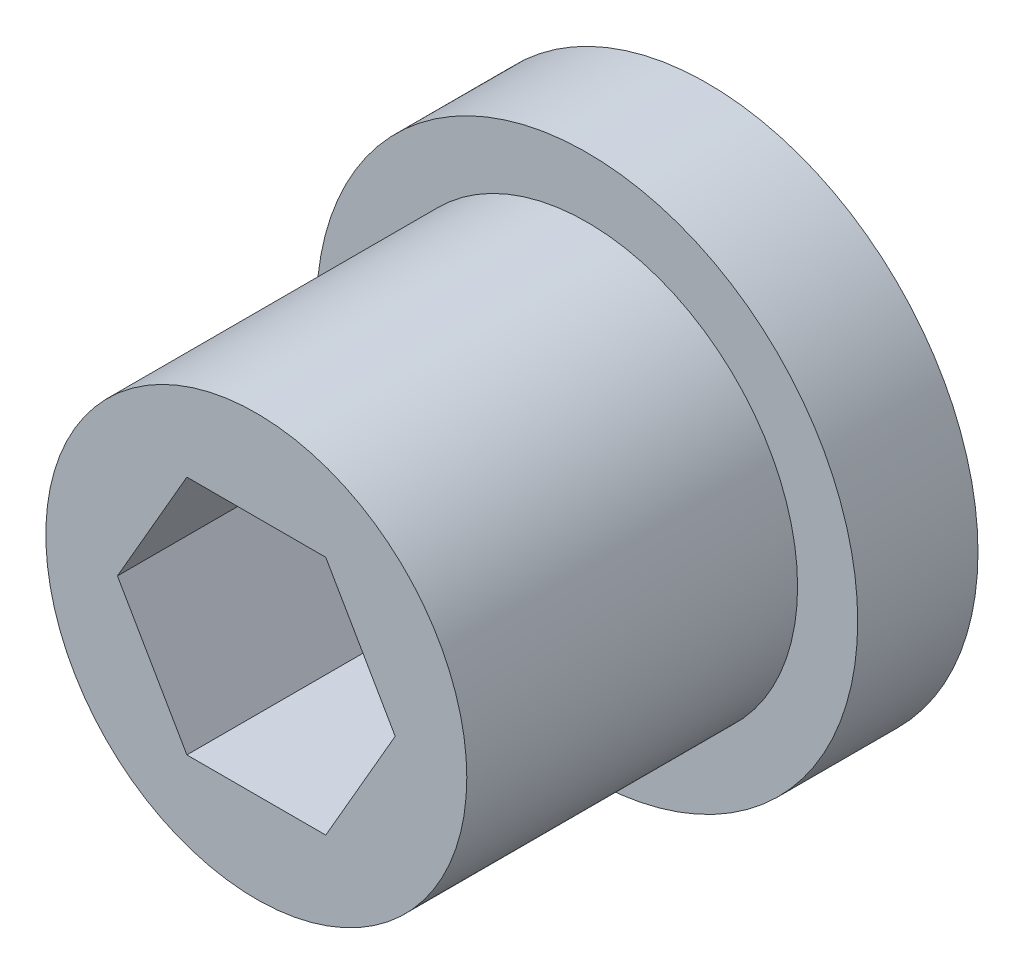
ISO-10303-21;
HEADER;
FILE_DESCRIPTION(('STEP AP214'),'2;1');
FILE_NAME('part.step','',(''),(''),'','','');
FILE_SCHEMA(('AUTOMOTIVE_DESIGN { 1 0 10303 214 1 1 1 1 }'));
ENDSEC;
DATA;
#1=APPLICATION_CONTEXT('core data for automotive mechanical design processes');
#2=APPLICATION_PROTOCOL_DEFINITION('international standard','automotive_design',2000,#1);
#3=PRODUCT_CONTEXT('',#1,'mechanical');
#4=PRODUCT('Part','Part','',(#3));
#5=PRODUCT_RELATED_PRODUCT_CATEGORY('part','',(#4));
#6=PRODUCT_DEFINITION_FORMATION('','',#4);
#7=PRODUCT_DEFINITION_CONTEXT('part definition',#1,'design');
#8=PRODUCT_DEFINITION('design','',#6,#7);
#9=PRODUCT_DEFINITION_SHAPE('','',#8);
#10=(LENGTH_UNIT() NAMED_UNIT(*) SI_UNIT(.MILLI.,.METRE.));
#11=(NAMED_UNIT(*) PLANE_ANGLE_UNIT() SI_UNIT($,.RADIAN.));
#12=(NAMED_UNIT(*) SI_UNIT($,.STERADIAN.) SOLID_ANGLE_UNIT());
#13=UNCERTAINTY_MEASURE_WITH_UNIT(LENGTH_MEASURE(1.E-05),#10,'distance_accuracy_value','');
#14=(GEOMETRIC_REPRESENTATION_CONTEXT(3) GLOBAL_UNCERTAINTY_ASSIGNED_CONTEXT((#13)) GLOBAL_UNIT_ASSIGNED_CONTEXT((#10,
#11,#12)) REPRESENTATION_CONTEXT('',''));
#15=CARTESIAN_POINT('',(0.,0.,0.));
#16=DIRECTION('',(0.,0.,1.));
#17=DIRECTION('',(1.,0.,0.));
#18=AXIS2_PLACEMENT_3D('',#15,#16,#17);
#19=CARTESIAN_POINT('',(0.,0.,2.));
#20=DIRECTION('',(0.,0.,-1.));
#21=DIRECTION('',(-1.,0.,0.));
#22=AXIS2_PLACEMENT_3D('',#19,#20,#21);
#23=CYLINDRICAL_SURFACE('',#22,4.5);
#24=CARTESIAN_POINT('',(0.,0.,2.));
#25=DIRECTION('',(0.,0.,1.));
#26=DIRECTION('',(1.,0.,0.));
#27=AXIS2_PLACEMENT_3D('',#24,#25,#26);
#28=CIRCLE('',#27,4.5);
#29=CARTESIAN_POINT('',(4.5,0.,2.));
#30=VERTEX_POINT('',#29);
#31=EDGE_CURVE('E33',#30,#30,#28,.T.);
#32=ORIENTED_EDGE('',*,*,#31,.F.);
#33=EDGE_LOOP('',(#32));
#34=FACE_BOUND('',#33,.T.);
#35=CARTESIAN_POINT('',(0.,0.,0.));
#36=DIRECTION('',(0.,0.,1.));
#37=DIRECTION('',(1.,0.,0.));
#38=AXIS2_PLACEMENT_3D('',#35,#36,#37);
#39=CIRCLE('',#38,4.5);
#40=CARTESIAN_POINT('',(4.5,0.,0.));
#41=VERTEX_POINT('',#40);
#42=EDGE_CURVE('E138',#41,#41,#39,.T.);
#43=ORIENTED_EDGE('',*,*,#42,.T.);
#44=EDGE_LOOP('',(#43));
#45=FACE_BOUND('',#44,.T.);
#46=ADVANCED_FACE('F30',(#34,#45),#23,.T.);
#47=CARTESIAN_POINT('',(0.,0.,2.));
#48=DIRECTION('',(0.,0.,1.));
#49=DIRECTION('',(1.,0.,0.));
#50=AXIS2_PLACEMENT_3D('',#47,#48,#49);
#51=PLANE('',#50);
#52=CARTESIAN_POINT('',(0.,0.,2.));
#53=DIRECTION('',(0.,0.,1.));
#54=DIRECTION('',(1.,0.,0.));
#55=AXIS2_PLACEMENT_3D('',#52,#53,#54);
#56=CIRCLE('',#55,3.5);
#57=CARTESIAN_POINT('',(3.5,0.,2.));
#58=VERTEX_POINT('',#57);
#59=EDGE_CURVE('E11',#58,#58,#56,.T.);
#60=ORIENTED_EDGE('',*,*,#59,.F.);
#61=EDGE_LOOP('',(#60));
#62=FACE_BOUND('',#61,.T.);
#63=ORIENTED_EDGE('',*,*,#31,.T.);
#64=EDGE_LOOP('',(#63));
#65=FACE_BOUND('',#64,.T.);
#66=ADVANCED_FACE('F145',(#62,#65),#51,.T.);
#67=CARTESIAN_POINT('',(0.,0.,0.));
#68=DIRECTION('',(0.,0.,1.));
#69=DIRECTION('',(1.,0.,0.));
#70=AXIS2_PLACEMENT_3D('',#67,#68,#69);
#71=PLANE('',#70);
#72=DIRECTION('',(-1.,0.,0.));
#73=VECTOR('',#72,1.);
#74=CARTESIAN_POINT('',(-1.15470053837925,2.,0.));
#75=LINE('',#74,#73);
#76=CARTESIAN_POINT('',(1.15470053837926,2.,0.));
#77=VERTEX_POINT('',#76);
#78=CARTESIAN_POINT('',(-1.15470053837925,2.,0.));
#79=VERTEX_POINT('',#78);
#80=EDGE_CURVE('E125',#77,#79,#75,.T.);
#81=ORIENTED_EDGE('',*,*,#80,.T.);
#82=DIRECTION('',(-0.499999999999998,-0.86602540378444,0.));
#83=VECTOR('',#82,1.);
#84=CARTESIAN_POINT('',(-1.15470053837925,2.,0.));
#85=LINE('',#84,#83);
#86=CARTESIAN_POINT('',(-2.3094010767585,0.,0.));
#87=VERTEX_POINT('',#86);
#88=EDGE_CURVE('E113',#79,#87,#85,.T.);
#89=ORIENTED_EDGE('',*,*,#88,.T.);
#90=DIRECTION('',(0.499999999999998,-0.866025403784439,0.));
#91=VECTOR('',#90,1.);
#92=CARTESIAN_POINT('',(-1.15470053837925,-2.,0.));
#93=LINE('',#92,#91);
#94=CARTESIAN_POINT('',(-1.15470053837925,-2.,0.));
#95=VERTEX_POINT('',#94);
#96=EDGE_CURVE('E116',#87,#95,#93,.T.);
#97=ORIENTED_EDGE('',*,*,#96,.T.);
#98=DIRECTION('',(1.,0.,0.));
#99=VECTOR('',#98,1.);
#100=CARTESIAN_POINT('',(-1.15470053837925,-2.,0.));
#101=LINE('',#100,#99);
#102=CARTESIAN_POINT('',(1.15470053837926,-2.,0.));
#103=VERTEX_POINT('',#102);
#104=EDGE_CURVE('E45',#95,#103,#101,.T.);
#105=ORIENTED_EDGE('',*,*,#104,.T.);
#106=DIRECTION('',(0.499999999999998,0.86602540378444,0.));
#107=VECTOR('',#106,1.);
#108=CARTESIAN_POINT('',(1.15470053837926,-2.,0.));
#109=LINE('',#108,#107);
#110=CARTESIAN_POINT('',(2.3094010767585,0.,0.));
#111=VERTEX_POINT('',#110);
#112=EDGE_CURVE('E119',#103,#111,#109,.T.);
#113=ORIENTED_EDGE('',*,*,#112,.T.);
#114=DIRECTION('',(-0.499999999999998,0.86602540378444,0.));
#115=VECTOR('',#114,1.);
#116=CARTESIAN_POINT('',(1.15470053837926,2.,0.));
#117=LINE('',#116,#115);
#118=EDGE_CURVE('E122',#111,#77,#117,.T.);
#119=ORIENTED_EDGE('',*,*,#118,.T.);
#120=EDGE_LOOP('',(#81,#89,#97,#105,#113,#119));
#121=FACE_BOUND('',#120,.T.);
#122=ORIENTED_EDGE('',*,*,#42,.F.);
#123=EDGE_LOOP('',(#122));
#124=FACE_BOUND('',#123,.T.);
#125=ADVANCED_FACE('F151',(#121,#124),#71,.F.);
#126=CARTESIAN_POINT('',(0.,0.,7.5));
#127=DIRECTION('',(0.,0.,-1.));
#128=DIRECTION('',(-1.,0.,0.));
#129=AXIS2_PLACEMENT_3D('',#126,#127,#128);
#130=CYLINDRICAL_SURFACE('',#129,3.5);
#131=CARTESIAN_POINT('',(0.,0.,7.5));
#132=DIRECTION('',(0.,0.,1.));
#133=DIRECTION('',(1.,0.,0.));
#134=AXIS2_PLACEMENT_3D('',#131,#132,#133);
#135=CIRCLE('',#134,3.5);
#136=CARTESIAN_POINT('',(3.5,0.,7.5));
#137=VERTEX_POINT('',#136);
#138=EDGE_CURVE('E130',#137,#137,#135,.T.);
#139=ORIENTED_EDGE('',*,*,#138,.F.);
#140=EDGE_LOOP('',(#139));
#141=FACE_BOUND('',#140,.T.);
#142=ORIENTED_EDGE('',*,*,#59,.T.);
#143=EDGE_LOOP('',(#142));
#144=FACE_BOUND('',#143,.T.);
#145=ADVANCED_FACE('F156',(#141,#144),#130,.T.);
#146=CARTESIAN_POINT('',(0.,0.,7.5));
#147=DIRECTION('',(0.,0.,1.));
#148=DIRECTION('',(1.,0.,0.));
#149=AXIS2_PLACEMENT_3D('',#146,#147,#148);
#150=PLANE('',#149);
#151=DIRECTION('',(-0.499999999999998,-0.86602540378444,0.));
#152=VECTOR('',#151,1.);
#153=CARTESIAN_POINT('',(-1.15470053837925,2.,7.5));
#154=LINE('',#153,#152);
#155=CARTESIAN_POINT('',(-1.15470053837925,2.,7.5));
#156=VERTEX_POINT('',#155);
#157=CARTESIAN_POINT('',(-2.3094010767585,0.,7.5));
#158=VERTEX_POINT('',#157);
#159=EDGE_CURVE('E53',#156,#158,#154,.T.);
#160=ORIENTED_EDGE('',*,*,#159,.F.);
#161=DIRECTION('',(-1.,0.,0.));
#162=VECTOR('',#161,1.);
#163=CARTESIAN_POINT('',(-1.15470053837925,2.,7.5));
#164=LINE('',#163,#162);
#165=CARTESIAN_POINT('',(1.15470053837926,2.,7.5));
#166=VERTEX_POINT('',#165);
#167=EDGE_CURVE('E110',#166,#156,#164,.T.);
#168=ORIENTED_EDGE('',*,*,#167,.F.);
#169=DIRECTION('',(-0.499999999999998,0.86602540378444,0.));
#170=VECTOR('',#169,1.);
#171=CARTESIAN_POINT('',(1.15470053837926,2.,7.5));
#172=LINE('',#171,#170);
#173=CARTESIAN_POINT('',(2.3094010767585,0.,7.5));
#174=VERTEX_POINT('',#173);
#175=EDGE_CURVE('E104',#174,#166,#172,.T.);
#176=ORIENTED_EDGE('',*,*,#175,.F.);
#177=DIRECTION('',(0.499999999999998,0.86602540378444,0.));
#178=VECTOR('',#177,1.);
#179=CARTESIAN_POINT('',(1.15470053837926,-2.,7.5));
#180=LINE('',#179,#178);
#181=CARTESIAN_POINT('',(1.15470053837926,-2.,7.5));
#182=VERTEX_POINT('',#181);
#183=EDGE_CURVE('E102',#182,#174,#180,.T.);
#184=ORIENTED_EDGE('',*,*,#183,.F.);
#185=DIRECTION('',(1.,0.,0.));
#186=VECTOR('',#185,1.);
#187=CARTESIAN_POINT('',(-1.15470053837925,-2.,7.5));
#188=LINE('',#187,#186);
#189=CARTESIAN_POINT('',(-1.15470053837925,-2.,7.5));
#190=VERTEX_POINT('',#189);
#191=EDGE_CURVE('E85',#190,#182,#188,.T.);
#192=ORIENTED_EDGE('',*,*,#191,.F.);
#193=DIRECTION('',(0.499999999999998,-0.866025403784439,0.));
#194=VECTOR('',#193,1.);
#195=CARTESIAN_POINT('',(-1.15470053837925,-2.,7.5));
#196=LINE('',#195,#194);
#197=EDGE_CURVE('E94',#158,#190,#196,.T.);
#198=ORIENTED_EDGE('',*,*,#197,.F.);
#199=EDGE_LOOP('',(#160,#168,#176,#184,#192,#198));
#200=FACE_BOUND('',#199,.T.);
#201=ORIENTED_EDGE('',*,*,#138,.T.);
#202=EDGE_LOOP('',(#201));
#203=FACE_BOUND('',#202,.T.);
#204=ADVANCED_FACE('F98',(#200,#203),#150,.T.);
#205=CARTESIAN_POINT('',(-1.15470053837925,2.,0.));
#206=DIRECTION('',(-0.86602540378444,0.499999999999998,0.));
#207=DIRECTION('',(-0.499999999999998,-0.86602540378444,0.));
#208=AXIS2_PLACEMENT_3D('',#205,#206,#207);
#209=PLANE('',#208);
#210=ORIENTED_EDGE('',*,*,#159,.T.);
#211=DIRECTION('',(0.,0.,1.));
#212=VECTOR('',#211,1.);
#213=CARTESIAN_POINT('',(-2.3094010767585,0.,0.));
#214=LINE('',#213,#212);
#215=EDGE_CURVE('E91',#87,#158,#214,.T.);
#216=ORIENTED_EDGE('',*,*,#215,.F.);
#217=ORIENTED_EDGE('',*,*,#88,.F.);
#218=DIRECTION('',(0.,0.,1.));
#219=VECTOR('',#218,1.);
#220=CARTESIAN_POINT('',(-1.15470053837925,2.,0.));
#221=LINE('',#220,#219);
#222=EDGE_CURVE('E128',#79,#156,#221,.T.);
#223=ORIENTED_EDGE('',*,*,#222,.T.);
#224=EDGE_LOOP('',(#210,#216,#217,#223));
#225=FACE_BOUND('',#224,.T.);
#226=ADVANCED_FACE('F166',(#225),#209,.F.);
#227=CARTESIAN_POINT('',(-1.15470053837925,2.,0.));
#228=DIRECTION('',(0.,1.,0.));
#229=DIRECTION('',(-1.,0.,0.));
#230=AXIS2_PLACEMENT_3D('',#227,#228,#229);
#231=PLANE('',#230);
#232=ORIENTED_EDGE('',*,*,#167,.T.);
#233=ORIENTED_EDGE('',*,*,#222,.F.);
#234=ORIENTED_EDGE('',*,*,#80,.F.);
#235=DIRECTION('',(0.,0.,1.));
#236=VECTOR('',#235,1.);
#237=CARTESIAN_POINT('',(1.15470053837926,2.,0.));
#238=LINE('',#237,#236);
#239=EDGE_CURVE('E131',#77,#166,#238,.T.);
#240=ORIENTED_EDGE('',*,*,#239,.T.);
#241=EDGE_LOOP('',(#232,#233,#234,#240));
#242=FACE_BOUND('',#241,.T.);
#243=ADVANCED_FACE('F169',(#242),#231,.F.);
#244=CARTESIAN_POINT('',(1.15470053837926,2.,0.));
#245=DIRECTION('',(0.86602540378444,0.499999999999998,0.));
#246=DIRECTION('',(-0.499999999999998,0.86602540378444,0.));
#247=AXIS2_PLACEMENT_3D('',#244,#245,#246);
#248=PLANE('',#247);
#249=ORIENTED_EDGE('',*,*,#175,.T.);
#250=ORIENTED_EDGE('',*,*,#239,.F.);
#251=ORIENTED_EDGE('',*,*,#118,.F.);
#252=DIRECTION('',(0.,0.,1.));
#253=VECTOR('',#252,1.);
#254=CARTESIAN_POINT('',(2.3094010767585,0.,0.));
#255=LINE('',#254,#253);
#256=EDGE_CURVE('E133',#111,#174,#255,.T.);
#257=ORIENTED_EDGE('',*,*,#256,.T.);
#258=EDGE_LOOP('',(#249,#250,#251,#257));
#259=FACE_BOUND('',#258,.T.);
#260=ADVANCED_FACE('F177',(#259),#248,.F.);
#261=CARTESIAN_POINT('',(1.15470053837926,-2.,0.));
#262=DIRECTION('',(0.86602540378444,-0.499999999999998,0.));
#263=DIRECTION('',(0.499999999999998,0.86602540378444,0.));
#264=AXIS2_PLACEMENT_3D('',#261,#262,#263);
#265=PLANE('',#264);
#266=ORIENTED_EDGE('',*,*,#183,.T.);
#267=ORIENTED_EDGE('',*,*,#256,.F.);
#268=ORIENTED_EDGE('',*,*,#112,.F.);
#269=DIRECTION('',(0.,0.,1.));
#270=VECTOR('',#269,1.);
#271=CARTESIAN_POINT('',(1.15470053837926,-2.,0.));
#272=LINE('',#271,#270);
#273=EDGE_CURVE('E90',#103,#182,#272,.T.);
#274=ORIENTED_EDGE('',*,*,#273,.T.);
#275=EDGE_LOOP('',(#266,#267,#268,#274));
#276=FACE_BOUND('',#275,.T.);
#277=ADVANCED_FACE('F174',(#276),#265,.F.);
#278=CARTESIAN_POINT('',(-1.15470053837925,-2.,0.));
#279=DIRECTION('',(0.,-1.,0.));
#280=DIRECTION('',(1.,0.,0.));
#281=AXIS2_PLACEMENT_3D('',#278,#279,#280);
#282=PLANE('',#281);
#283=ORIENTED_EDGE('',*,*,#191,.T.);
#284=ORIENTED_EDGE('',*,*,#273,.F.);
#285=ORIENTED_EDGE('',*,*,#104,.F.);
#286=DIRECTION('',(0.,0.,1.));
#287=VECTOR('',#286,1.);
#288=CARTESIAN_POINT('',(-1.15470053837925,-2.,0.));
#289=LINE('',#288,#287);
#290=EDGE_CURVE('E81',#95,#190,#289,.T.);
#291=ORIENTED_EDGE('',*,*,#290,.T.);
#292=EDGE_LOOP('',(#283,#284,#285,#291));
#293=FACE_BOUND('',#292,.T.);
#294=ADVANCED_FACE('F83',(#293),#282,.F.);
#295=CARTESIAN_POINT('',(-1.15470053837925,-2.,0.));
#296=DIRECTION('',(-0.866025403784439,-0.499999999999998,0.));
#297=DIRECTION('',(0.499999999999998,-0.86602540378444,0.));
#298=AXIS2_PLACEMENT_3D('',#295,#296,#297);
#299=PLANE('',#298);
#300=ORIENTED_EDGE('',*,*,#197,.T.);
#301=ORIENTED_EDGE('',*,*,#290,.F.);
#302=ORIENTED_EDGE('',*,*,#96,.F.);
#303=ORIENTED_EDGE('',*,*,#215,.T.);
#304=EDGE_LOOP('',(#300,#301,#302,#303));
#305=FACE_BOUND('',#304,.T.);
#306=ADVANCED_FACE('F95',(#305),#299,.F.);
#307=CLOSED_SHELL('',(#46,#66,#125,#145,#204,#226,#243,#260,#277,#294,#306));
#308=MANIFOLD_SOLID_BREP('B2',#307);
#309=ADVANCED_BREP_SHAPE_REPRESENTATION('',(#18,#308),#14);
#310=SHAPE_DEFINITION_REPRESENTATION(#9,#309);
ENDSEC;
END-ISO-10303-21;
